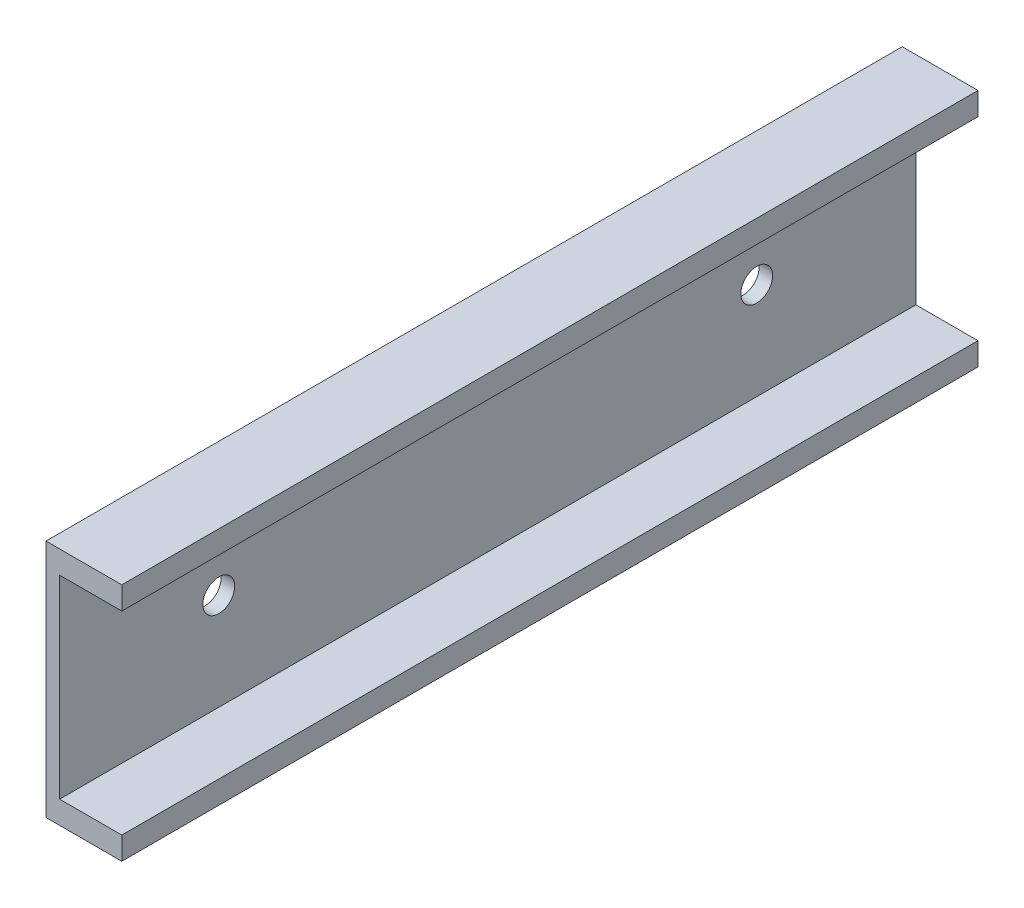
ISO-10303-21;
HEADER;
FILE_DESCRIPTION(('STEP AP214'),'2;1');
FILE_NAME('part.step','',(''),(''),'','','');
FILE_SCHEMA(('AUTOMOTIVE_DESIGN { 1 0 10303 214 1 1 1 1 }'));
ENDSEC;
DATA;
#1=APPLICATION_CONTEXT('core data for automotive mechanical design processes');
#2=APPLICATION_PROTOCOL_DEFINITION('international standard','automotive_design',2000,#1);
#3=PRODUCT_CONTEXT('',#1,'mechanical');
#4=PRODUCT('Part','Part','',(#3));
#5=PRODUCT_RELATED_PRODUCT_CATEGORY('part','',(#4));
#6=PRODUCT_DEFINITION_FORMATION('','',#4);
#7=PRODUCT_DEFINITION_CONTEXT('part definition',#1,'design');
#8=PRODUCT_DEFINITION('design','',#6,#7);
#9=PRODUCT_DEFINITION_SHAPE('','',#8);
#10=(LENGTH_UNIT() NAMED_UNIT(*) SI_UNIT(.MILLI.,.METRE.));
#11=(NAMED_UNIT(*) PLANE_ANGLE_UNIT() SI_UNIT($,.RADIAN.));
#12=(NAMED_UNIT(*) SI_UNIT($,.STERADIAN.) SOLID_ANGLE_UNIT());
#13=UNCERTAINTY_MEASURE_WITH_UNIT(LENGTH_MEASURE(1.E-05),#10,'distance_accuracy_value','');
#14=(GEOMETRIC_REPRESENTATION_CONTEXT(3) GLOBAL_UNCERTAINTY_ASSIGNED_CONTEXT((#13)) GLOBAL_UNIT_ASSIGNED_CONTEXT((#10,
#11,#12)) REPRESENTATION_CONTEXT('',''));
#15=CARTESIAN_POINT('',(0.,0.,0.));
#16=DIRECTION('',(0.,0.,1.));
#17=DIRECTION('',(1.,0.,0.));
#18=AXIS2_PLACEMENT_3D('',#15,#16,#17);
#19=CARTESIAN_POINT('',(0.,1.5,56.5));
#20=DIRECTION('',(0.,1.,0.));
#21=DIRECTION('',(-1.,0.,0.));
#22=AXIS2_PLACEMENT_3D('',#19,#20,#21);
#23=PLANE('',#22);
#24=DIRECTION('',(1.,0.,0.));
#25=VECTOR('',#24,1.);
#26=CARTESIAN_POINT('',(0.,1.5,0.));
#27=LINE('',#26,#25);
#28=CARTESIAN_POINT('',(0.899999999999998,1.5,0.));
#29=VERTEX_POINT('',#28);
#30=CARTESIAN_POINT('',(5.,1.5,0.));
#31=VERTEX_POINT('',#30);
#32=EDGE_CURVE('E133',#29,#31,#27,.T.);
#33=ORIENTED_EDGE('',*,*,#32,.F.);
#34=DIRECTION('',(0.,0.,-1.));
#35=VECTOR('',#34,1.);
#36=CARTESIAN_POINT('',(0.899999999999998,1.5,56.5));
#37=LINE('',#36,#35);
#38=CARTESIAN_POINT('',(0.899999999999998,1.5,56.5));
#39=VERTEX_POINT('',#38);
#40=EDGE_CURVE('E11',#39,#29,#37,.T.);
#41=ORIENTED_EDGE('',*,*,#40,.F.);
#42=DIRECTION('',(1.,0.,0.));
#43=VECTOR('',#42,1.);
#44=CARTESIAN_POINT('',(0.,1.5,56.5));
#45=LINE('',#44,#43);
#46=CARTESIAN_POINT('',(5.,1.5,56.5));
#47=VERTEX_POINT('',#46);
#48=EDGE_CURVE('E175',#39,#47,#45,.T.);
#49=ORIENTED_EDGE('',*,*,#48,.T.);
#50=DIRECTION('',(0.,0.,-1.));
#51=VECTOR('',#50,1.);
#52=CARTESIAN_POINT('',(5.,1.5,56.5));
#53=LINE('',#52,#51);
#54=EDGE_CURVE('E91',#47,#31,#53,.T.);
#55=ORIENTED_EDGE('',*,*,#54,.T.);
#56=EDGE_LOOP('',(#33,#41,#49,#55));
#57=FACE_BOUND('',#56,.T.);
#58=ADVANCED_FACE('F41',(#57),#23,.T.);
#59=CARTESIAN_POINT('',(0.899999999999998,0.,56.5));
#60=DIRECTION('',(1.,0.,0.));
#61=DIRECTION('',(0.,1.,0.));
#62=AXIS2_PLACEMENT_3D('',#59,#60,#61);
#63=PLANE('',#62);
#64=CARTESIAN_POINT('',(0.899999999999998,7.9,46.));
#65=DIRECTION('',(1.,0.,0.));
#66=DIRECTION('',(0.,1.,0.));
#67=AXIS2_PLACEMENT_3D('',#64,#65,#66);
#68=CIRCLE('',#67,1.05);
#69=CARTESIAN_POINT('',(0.899999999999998,8.95,46.));
#70=VERTEX_POINT('',#69);
#71=EDGE_CURVE('E213',#70,#70,#68,.T.);
#72=ORIENTED_EDGE('',*,*,#71,.F.);
#73=EDGE_LOOP('',(#72));
#74=FACE_BOUND('',#73,.T.);
#75=CARTESIAN_POINT('',(0.899999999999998,7.9,10.5));
#76=DIRECTION('',(1.,0.,0.));
#77=DIRECTION('',(0.,1.,0.));
#78=AXIS2_PLACEMENT_3D('',#75,#76,#77);
#79=CIRCLE('',#78,1.05);
#80=CARTESIAN_POINT('',(0.899999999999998,8.95,10.5));
#81=VERTEX_POINT('',#80);
#82=EDGE_CURVE('E216',#81,#81,#79,.T.);
#83=ORIENTED_EDGE('',*,*,#82,.F.);
#84=EDGE_LOOP('',(#83));
#85=FACE_BOUND('',#84,.T.);
#86=DIRECTION('',(0.,-1.,0.));
#87=VECTOR('',#86,1.);
#88=CARTESIAN_POINT('',(0.899999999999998,0.,0.));
#89=LINE('',#88,#87);
#90=CARTESIAN_POINT('',(0.899999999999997,14.3,0.));
#91=VERTEX_POINT('',#90);
#92=EDGE_CURVE('E136',#91,#29,#89,.T.);
#93=ORIENTED_EDGE('',*,*,#92,.F.);
#94=DIRECTION('',(0.,0.,-1.));
#95=VECTOR('',#94,1.);
#96=CARTESIAN_POINT('',(0.899999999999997,14.3,56.5));
#97=LINE('',#96,#95);
#98=CARTESIAN_POINT('',(0.899999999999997,14.3,56.5));
#99=VERTEX_POINT('',#98);
#100=EDGE_CURVE('E49',#99,#91,#97,.T.);
#101=ORIENTED_EDGE('',*,*,#100,.F.);
#102=DIRECTION('',(0.,-1.,0.));
#103=VECTOR('',#102,1.);
#104=CARTESIAN_POINT('',(0.899999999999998,0.,56.5));
#105=LINE('',#104,#103);
#106=EDGE_CURVE('E172',#99,#39,#105,.T.);
#107=ORIENTED_EDGE('',*,*,#106,.T.);
#108=ORIENTED_EDGE('',*,*,#40,.T.);
#109=EDGE_LOOP('',(#93,#101,#107,#108));
#110=FACE_BOUND('',#109,.T.);
#111=ADVANCED_FACE('F171',(#74,#85,#110),#63,.T.);
#112=CARTESIAN_POINT('',(0.,14.3,56.5));
#113=DIRECTION('',(0.,1.,0.));
#114=DIRECTION('',(0.,0.,1.));
#115=AXIS2_PLACEMENT_3D('',#112,#113,#114);
#116=PLANE('',#115);
#117=DIRECTION('',(1.,0.,0.));
#118=VECTOR('',#117,1.);
#119=CARTESIAN_POINT('',(0.,14.3,0.));
#120=LINE('',#119,#118);
#121=CARTESIAN_POINT('',(5.,14.3,0.));
#122=VERTEX_POINT('',#121);
#123=EDGE_CURVE('E140',#91,#122,#120,.T.);
#124=ORIENTED_EDGE('',*,*,#123,.T.);
#125=DIRECTION('',(0.,0.,-1.));
#126=VECTOR('',#125,1.);
#127=CARTESIAN_POINT('',(5.,14.3,56.5));
#128=LINE('',#127,#126);
#129=CARTESIAN_POINT('',(5.,14.3,56.5));
#130=VERTEX_POINT('',#129);
#131=EDGE_CURVE('E156',#130,#122,#128,.T.);
#132=ORIENTED_EDGE('',*,*,#131,.F.);
#133=DIRECTION('',(1.,0.,0.));
#134=VECTOR('',#133,1.);
#135=CARTESIAN_POINT('',(0.,14.3,56.5));
#136=LINE('',#135,#134);
#137=EDGE_CURVE('E163',#99,#130,#136,.T.);
#138=ORIENTED_EDGE('',*,*,#137,.F.);
#139=ORIENTED_EDGE('',*,*,#100,.T.);
#140=EDGE_LOOP('',(#124,#132,#138,#139));
#141=FACE_BOUND('',#140,.T.);
#142=ADVANCED_FACE('F161',(#141),#116,.F.);
#143=CARTESIAN_POINT('',(5.,0.,56.5));
#144=DIRECTION('',(-1.,0.,0.));
#145=DIRECTION('',(0.,-1.,0.));
#146=AXIS2_PLACEMENT_3D('',#143,#144,#145);
#147=PLANE('',#146);
#148=DIRECTION('',(0.,1.,0.));
#149=VECTOR('',#148,1.);
#150=CARTESIAN_POINT('',(5.,0.,0.));
#151=LINE('',#150,#149);
#152=CARTESIAN_POINT('',(5.,15.8,0.));
#153=VERTEX_POINT('',#152);
#154=EDGE_CURVE('E142',#122,#153,#151,.T.);
#155=ORIENTED_EDGE('',*,*,#154,.T.);
#156=DIRECTION('',(0.,0.,-1.));
#157=VECTOR('',#156,1.);
#158=CARTESIAN_POINT('',(5.,15.8,56.5));
#159=LINE('',#158,#157);
#160=CARTESIAN_POINT('',(5.,15.8,56.5));
#161=VERTEX_POINT('',#160);
#162=EDGE_CURVE('E154',#161,#153,#159,.T.);
#163=ORIENTED_EDGE('',*,*,#162,.F.);
#164=DIRECTION('',(0.,1.,0.));
#165=VECTOR('',#164,1.);
#166=CARTESIAN_POINT('',(5.,0.,56.5));
#167=LINE('',#166,#165);
#168=EDGE_CURVE('E129',#130,#161,#167,.T.);
#169=ORIENTED_EDGE('',*,*,#168,.F.);
#170=ORIENTED_EDGE('',*,*,#131,.T.);
#171=EDGE_LOOP('',(#155,#163,#169,#170));
#172=FACE_BOUND('',#171,.T.);
#173=ADVANCED_FACE('F185',(#172),#147,.F.);
#174=CARTESIAN_POINT('',(0.,15.8,56.5));
#175=DIRECTION('',(0.,1.,0.));
#176=DIRECTION('',(0.,0.,1.));
#177=AXIS2_PLACEMENT_3D('',#174,#175,#176);
#178=PLANE('',#177);
#179=DIRECTION('',(1.,0.,0.));
#180=VECTOR('',#179,1.);
#181=CARTESIAN_POINT('',(0.,15.8,0.));
#182=LINE('',#181,#180);
#183=CARTESIAN_POINT('',(0.,15.8,0.));
#184=VERTEX_POINT('',#183);
#185=EDGE_CURVE('E145',#184,#153,#182,.T.);
#186=ORIENTED_EDGE('',*,*,#185,.F.);
#187=DIRECTION('',(0.,0.,-1.));
#188=VECTOR('',#187,1.);
#189=CARTESIAN_POINT('',(0.,15.8,56.5));
#190=LINE('',#189,#188);
#191=CARTESIAN_POINT('',(0.,15.8,56.5));
#192=VERTEX_POINT('',#191);
#193=EDGE_CURVE('E118',#192,#184,#190,.T.);
#194=ORIENTED_EDGE('',*,*,#193,.F.);
#195=DIRECTION('',(1.,0.,0.));
#196=VECTOR('',#195,1.);
#197=CARTESIAN_POINT('',(0.,15.8,56.5));
#198=LINE('',#197,#196);
#199=EDGE_CURVE('E127',#192,#161,#198,.T.);
#200=ORIENTED_EDGE('',*,*,#199,.T.);
#201=ORIENTED_EDGE('',*,*,#162,.T.);
#202=EDGE_LOOP('',(#186,#194,#200,#201));
#203=FACE_BOUND('',#202,.T.);
#204=ADVANCED_FACE('F188',(#203),#178,.T.);
#205=CARTESIAN_POINT('',(0.,0.,56.5));
#206=DIRECTION('',(-1.,0.,0.));
#207=DIRECTION('',(0.,-1.,0.));
#208=AXIS2_PLACEMENT_3D('',#205,#206,#207);
#209=PLANE('',#208);
#210=CARTESIAN_POINT('',(0.,7.9,46.));
#211=DIRECTION('',(1.,0.,0.));
#212=DIRECTION('',(0.,1.,0.));
#213=AXIS2_PLACEMENT_3D('',#210,#211,#212);
#214=CIRCLE('',#213,1.05);
#215=CARTESIAN_POINT('',(0.,8.95,46.));
#216=VERTEX_POINT('',#215);
#217=EDGE_CURVE('E137',#216,#216,#214,.T.);
#218=ORIENTED_EDGE('',*,*,#217,.T.);
#219=EDGE_LOOP('',(#218));
#220=FACE_BOUND('',#219,.T.);
#221=CARTESIAN_POINT('',(0.,7.9,10.5));
#222=DIRECTION('',(1.,0.,0.));
#223=DIRECTION('',(0.,1.,0.));
#224=AXIS2_PLACEMENT_3D('',#221,#222,#223);
#225=CIRCLE('',#224,1.05);
#226=CARTESIAN_POINT('',(0.,8.95,10.5));
#227=VERTEX_POINT('',#226);
#228=EDGE_CURVE('E179',#227,#227,#225,.T.);
#229=ORIENTED_EDGE('',*,*,#228,.T.);
#230=EDGE_LOOP('',(#229));
#231=FACE_BOUND('',#230,.T.);
#232=DIRECTION('',(0.,1.,0.));
#233=VECTOR('',#232,1.);
#234=CARTESIAN_POINT('',(0.,0.,0.));
#235=LINE('',#234,#233);
#236=CARTESIAN_POINT('',(0.,0.,0.));
#237=VERTEX_POINT('',#236);
#238=EDGE_CURVE('E117',#237,#184,#235,.T.);
#239=ORIENTED_EDGE('',*,*,#238,.F.);
#240=DIRECTION('',(0.,0.,-1.));
#241=VECTOR('',#240,1.);
#242=CARTESIAN_POINT('',(0.,0.,56.5));
#243=LINE('',#242,#241);
#244=CARTESIAN_POINT('',(0.,0.,56.5));
#245=VERTEX_POINT('',#244);
#246=EDGE_CURVE('E111',#245,#237,#243,.T.);
#247=ORIENTED_EDGE('',*,*,#246,.F.);
#248=DIRECTION('',(0.,1.,0.));
#249=VECTOR('',#248,1.);
#250=CARTESIAN_POINT('',(0.,0.,56.5));
#251=LINE('',#250,#249);
#252=EDGE_CURVE('E115',#245,#192,#251,.T.);
#253=ORIENTED_EDGE('',*,*,#252,.T.);
#254=ORIENTED_EDGE('',*,*,#193,.T.);
#255=EDGE_LOOP('',(#239,#247,#253,#254));
#256=FACE_BOUND('',#255,.T.);
#257=ADVANCED_FACE('F113',(#220,#231,#256),#209,.T.);
#258=CARTESIAN_POINT('',(0.,0.,56.5));
#259=DIRECTION('',(0.,1.,0.));
#260=DIRECTION('',(0.,0.,1.));
#261=AXIS2_PLACEMENT_3D('',#258,#259,#260);
#262=PLANE('',#261);
#263=DIRECTION('',(1.,0.,0.));
#264=VECTOR('',#263,1.);
#265=CARTESIAN_POINT('',(0.,0.,0.));
#266=LINE('',#265,#264);
#267=CARTESIAN_POINT('',(5.,0.,0.));
#268=VERTEX_POINT('',#267);
#269=EDGE_CURVE('E84',#237,#268,#266,.T.);
#270=ORIENTED_EDGE('',*,*,#269,.T.);
#271=DIRECTION('',(0.,0.,-1.));
#272=VECTOR('',#271,1.);
#273=CARTESIAN_POINT('',(5.,0.,56.5));
#274=LINE('',#273,#272);
#275=CARTESIAN_POINT('',(5.,0.,56.5));
#276=VERTEX_POINT('',#275);
#277=EDGE_CURVE('E119',#276,#268,#274,.T.);
#278=ORIENTED_EDGE('',*,*,#277,.F.);
#279=DIRECTION('',(1.,0.,0.));
#280=VECTOR('',#279,1.);
#281=CARTESIAN_POINT('',(0.,0.,56.5));
#282=LINE('',#281,#280);
#283=EDGE_CURVE('E121',#245,#276,#282,.T.);
#284=ORIENTED_EDGE('',*,*,#283,.F.);
#285=ORIENTED_EDGE('',*,*,#246,.T.);
#286=EDGE_LOOP('',(#270,#278,#284,#285));
#287=FACE_BOUND('',#286,.T.);
#288=ADVANCED_FACE('F122',(#287),#262,.F.);
#289=EDGE_CURVE('E146',#268,#31,#151,.T.);
#290=ORIENTED_EDGE('',*,*,#289,.T.);
#291=ORIENTED_EDGE('',*,*,#54,.F.);
#292=EDGE_CURVE('E57',#276,#47,#167,.T.);
#293=ORIENTED_EDGE('',*,*,#292,.F.);
#294=ORIENTED_EDGE('',*,*,#277,.T.);
#295=EDGE_LOOP('',(#290,#291,#293,#294));
#296=FACE_BOUND('',#295,.T.);
#297=ADVANCED_FACE('F199',(#296),#147,.F.);
#298=CARTESIAN_POINT('',(0.,0.,56.5));
#299=DIRECTION('',(0.,0.,1.));
#300=DIRECTION('',(1.,0.,0.));
#301=AXIS2_PLACEMENT_3D('',#298,#299,#300);
#302=PLANE('',#301);
#303=ORIENTED_EDGE('',*,*,#48,.F.);
#304=ORIENTED_EDGE('',*,*,#106,.F.);
#305=ORIENTED_EDGE('',*,*,#137,.T.);
#306=ORIENTED_EDGE('',*,*,#168,.T.);
#307=ORIENTED_EDGE('',*,*,#199,.F.);
#308=ORIENTED_EDGE('',*,*,#252,.F.);
#309=ORIENTED_EDGE('',*,*,#283,.T.);
#310=ORIENTED_EDGE('',*,*,#292,.T.);
#311=EDGE_LOOP('',(#303,#304,#305,#306,#307,#308,#309,#310));
#312=FACE_BOUND('',#311,.T.);
#313=ADVANCED_FACE('F125',(#312),#302,.T.);
#314=CARTESIAN_POINT('',(0.,0.,0.));
#315=DIRECTION('',(0.,0.,1.));
#316=DIRECTION('',(1.,0.,0.));
#317=AXIS2_PLACEMENT_3D('',#314,#315,#316);
#318=PLANE('',#317);
#319=ORIENTED_EDGE('',*,*,#32,.T.);
#320=ORIENTED_EDGE('',*,*,#289,.F.);
#321=ORIENTED_EDGE('',*,*,#269,.F.);
#322=ORIENTED_EDGE('',*,*,#238,.T.);
#323=ORIENTED_EDGE('',*,*,#185,.T.);
#324=ORIENTED_EDGE('',*,*,#154,.F.);
#325=ORIENTED_EDGE('',*,*,#123,.F.);
#326=ORIENTED_EDGE('',*,*,#92,.T.);
#327=EDGE_LOOP('',(#319,#320,#321,#322,#323,#324,#325,#326));
#328=FACE_BOUND('',#327,.T.);
#329=ADVANCED_FACE('F170',(#328),#318,.F.);
#330=CARTESIAN_POINT('',(0.,7.9,10.5));
#331=DIRECTION('',(1.,0.,0.));
#332=DIRECTION('',(0.,1.,0.));
#333=AXIS2_PLACEMENT_3D('',#330,#331,#332);
#334=CYLINDRICAL_SURFACE('',#333,1.05);
#335=ORIENTED_EDGE('',*,*,#228,.F.);
#336=EDGE_LOOP('',(#335));
#337=FACE_BOUND('',#336,.T.);
#338=ORIENTED_EDGE('',*,*,#82,.T.);
#339=EDGE_LOOP('',(#338));
#340=FACE_BOUND('',#339,.T.);
#341=ADVANCED_FACE('F228',(#337,#340),#334,.F.);
#342=CARTESIAN_POINT('',(0.,7.9,46.));
#343=DIRECTION('',(1.,0.,0.));
#344=DIRECTION('',(0.,1.,0.));
#345=AXIS2_PLACEMENT_3D('',#342,#343,#344);
#346=CYLINDRICAL_SURFACE('',#345,1.05);
#347=ORIENTED_EDGE('',*,*,#217,.F.);
#348=EDGE_LOOP('',(#347));
#349=FACE_BOUND('',#348,.T.);
#350=ORIENTED_EDGE('',*,*,#71,.T.);
#351=EDGE_LOOP('',(#350));
#352=FACE_BOUND('',#351,.T.);
#353=ADVANCED_FACE('F225',(#349,#352),#346,.F.);
#354=CLOSED_SHELL('',(#58,#111,#142,#173,#204,#257,#288,#297,#313,#329,#341,#353));
#355=MANIFOLD_SOLID_BREP('B2',#354);
#356=ADVANCED_BREP_SHAPE_REPRESENTATION('',(#18,#355),#14);
#357=SHAPE_DEFINITION_REPRESENTATION(#9,#356);
ENDSEC;
END-ISO-10303-21;
